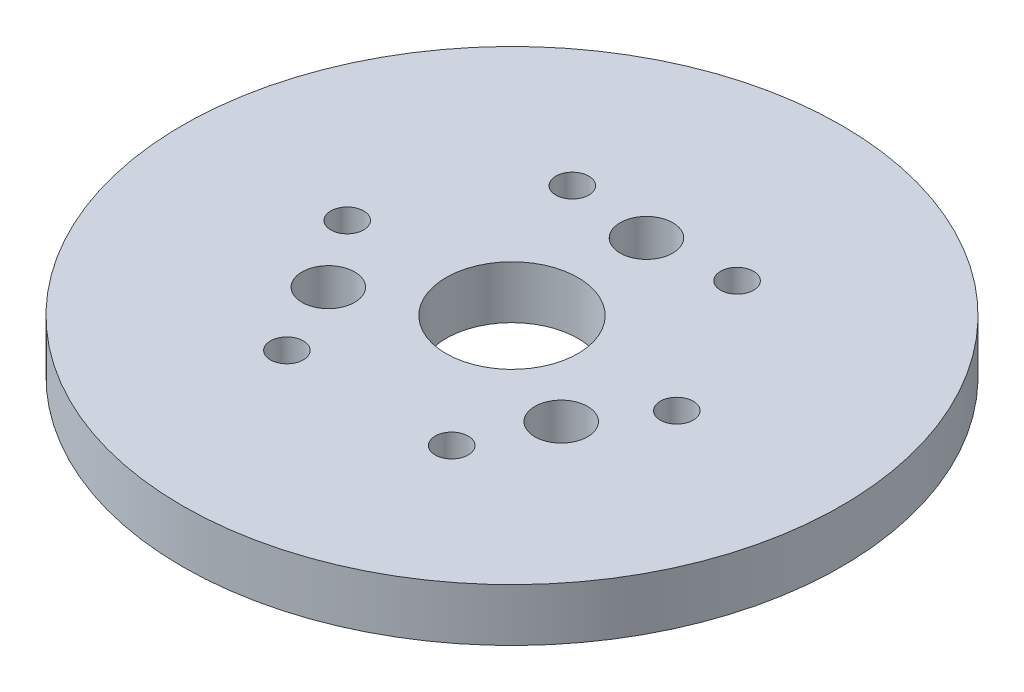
ISO-10303-21;
HEADER;
FILE_DESCRIPTION(('STEP AP214'),'2;1');
FILE_NAME('part.step','',(''),(''),'','','');
FILE_SCHEMA(('AUTOMOTIVE_DESIGN { 1 0 10303 214 1 1 1 1 }'));
ENDSEC;
DATA;
#1=APPLICATION_CONTEXT('core data for automotive mechanical design processes');
#2=APPLICATION_PROTOCOL_DEFINITION('international standard','automotive_design',2000,#1);
#3=PRODUCT_CONTEXT('',#1,'mechanical');
#4=PRODUCT('Part','Part','',(#3));
#5=PRODUCT_RELATED_PRODUCT_CATEGORY('part','',(#4));
#6=PRODUCT_DEFINITION_FORMATION('','',#4);
#7=PRODUCT_DEFINITION_CONTEXT('part definition',#1,'design');
#8=PRODUCT_DEFINITION('design','',#6,#7);
#9=PRODUCT_DEFINITION_SHAPE('','',#8);
#10=(LENGTH_UNIT() NAMED_UNIT(*) SI_UNIT(.MILLI.,.METRE.));
#11=(NAMED_UNIT(*) PLANE_ANGLE_UNIT() SI_UNIT($,.RADIAN.));
#12=(NAMED_UNIT(*) SI_UNIT($,.STERADIAN.) SOLID_ANGLE_UNIT());
#13=UNCERTAINTY_MEASURE_WITH_UNIT(LENGTH_MEASURE(1.E-05),#10,'distance_accuracy_value','');
#14=(GEOMETRIC_REPRESENTATION_CONTEXT(3) GLOBAL_UNCERTAINTY_ASSIGNED_CONTEXT((#13)) GLOBAL_UNIT_ASSIGNED_CONTEXT((#10,
#11,#12)) REPRESENTATION_CONTEXT('',''));
#15=CARTESIAN_POINT('',(0.,0.,0.));
#16=DIRECTION('',(0.,0.,1.));
#17=DIRECTION('',(1.,0.,0.));
#18=AXIS2_PLACEMENT_3D('',#15,#16,#17);
#19=CARTESIAN_POINT('',(0.,4.,0.));
#20=DIRECTION('',(0.,-1.,0.));
#21=DIRECTION('',(0.,0.,-1.));
#22=AXIS2_PLACEMENT_3D('',#19,#20,#21);
#23=CYLINDRICAL_SURFACE('',#22,25.);
#24=CARTESIAN_POINT('',(0.,4.,0.));
#25=DIRECTION('',(0.,1.,0.));
#26=DIRECTION('',(0.,0.,1.));
#27=AXIS2_PLACEMENT_3D('',#24,#25,#26);
#28=CIRCLE('',#27,25.);
#29=CARTESIAN_POINT('',(0.,4.,25.));
#30=VERTEX_POINT('',#29);
#31=EDGE_CURVE('E10',#30,#30,#28,.T.);
#32=ORIENTED_EDGE('',*,*,#31,.F.);
#33=EDGE_LOOP('',(#32));
#34=FACE_BOUND('',#33,.T.);
#35=CARTESIAN_POINT('',(0.,0.,0.));
#36=DIRECTION('',(0.,1.,0.));
#37=DIRECTION('',(0.,0.,1.));
#38=AXIS2_PLACEMENT_3D('',#35,#36,#37);
#39=CIRCLE('',#38,25.);
#40=CARTESIAN_POINT('',(0.,0.,25.));
#41=VERTEX_POINT('',#40);
#42=EDGE_CURVE('E51',#41,#41,#39,.T.);
#43=ORIENTED_EDGE('',*,*,#42,.T.);
#44=EDGE_LOOP('',(#43));
#45=FACE_BOUND('',#44,.T.);
#46=ADVANCED_FACE('F43',(#34,#45),#23,.T.);
#47=CARTESIAN_POINT('',(0.,4.,0.));
#48=DIRECTION('',(0.,1.,0.));
#49=DIRECTION('',(0.,0.,1.));
#50=AXIS2_PLACEMENT_3D('',#47,#48,#49);
#51=PLANE('',#50);
#52=CARTESIAN_POINT('',(0.,4.,-10.2));
#53=DIRECTION('',(0.,1.,0.));
#54=DIRECTION('',(0.,0.,1.));
#55=AXIS2_PLACEMENT_3D('',#52,#53,#54);
#56=CIRCLE('',#55,2.);
#57=CARTESIAN_POINT('',(0.,4.,-8.2));
#58=VERTEX_POINT('',#57);
#59=EDGE_CURVE('E206',#58,#58,#56,.T.);
#60=ORIENTED_EDGE('',*,*,#59,.F.);
#61=EDGE_LOOP('',(#60));
#62=FACE_BOUND('',#61,.T.);
#63=CARTESIAN_POINT('',(6.25,4.,-10.8253175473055));
#64=DIRECTION('',(0.,1.,0.));
#65=DIRECTION('',(0.,0.,1.));
#66=AXIS2_PLACEMENT_3D('',#63,#64,#65);
#67=CIRCLE('',#66,1.25);
#68=CARTESIAN_POINT('',(6.25,4.,-9.57531754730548));
#69=VERTEX_POINT('',#68);
#70=EDGE_CURVE('E210',#69,#69,#67,.T.);
#71=ORIENTED_EDGE('',*,*,#70,.F.);
#72=EDGE_LOOP('',(#71));
#73=FACE_BOUND('',#72,.T.);
#74=CARTESIAN_POINT('',(12.5000000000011,4.,-1.8395627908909E-12));
#75=DIRECTION('',(0.,1.,0.));
#76=DIRECTION('',(0.,0.,1.));
#77=AXIS2_PLACEMENT_3D('',#74,#75,#76);
#78=CIRCLE('',#77,1.25000000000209);
#79=CARTESIAN_POINT('',(12.5000000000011,4.,1.25000000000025));
#80=VERTEX_POINT('',#79);
#81=EDGE_CURVE('E193',#80,#80,#78,.T.);
#82=ORIENTED_EDGE('',*,*,#81,.F.);
#83=EDGE_LOOP('',(#82));
#84=FACE_BOUND('',#83,.T.);
#85=CARTESIAN_POINT('',(8.83345911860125,4.,5.10000000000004));
#86=DIRECTION('',(0.,1.,0.));
#87=DIRECTION('',(0.,0.,1.));
#88=AXIS2_PLACEMENT_3D('',#85,#86,#87);
#89=CIRCLE('',#88,2.);
#90=CARTESIAN_POINT('',(8.83345911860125,4.,7.10000000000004));
#91=VERTEX_POINT('',#90);
#92=EDGE_CURVE('E187',#91,#91,#89,.T.);
#93=ORIENTED_EDGE('',*,*,#92,.F.);
#94=EDGE_LOOP('',(#93));
#95=FACE_BOUND('',#94,.T.);
#96=CARTESIAN_POINT('',(6.25000000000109,4.,10.8253175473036));
#97=DIRECTION('',(0.,1.,0.));
#98=DIRECTION('',(0.,0.,1.));
#99=AXIS2_PLACEMENT_3D('',#96,#97,#98);
#100=CIRCLE('',#99,1.25000000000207);
#101=CARTESIAN_POINT('',(6.25000000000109,4.,12.0753175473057));
#102=VERTEX_POINT('',#101);
#103=EDGE_CURVE('E165',#102,#102,#100,.T.);
#104=ORIENTED_EDGE('',*,*,#103,.F.);
#105=EDGE_LOOP('',(#104));
#106=FACE_BOUND('',#105,.T.);
#107=CARTESIAN_POINT('',(-6.24999999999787,4.,10.8253175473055));
#108=DIRECTION('',(0.,1.,0.));
#109=DIRECTION('',(0.,0.,1.));
#110=AXIS2_PLACEMENT_3D('',#107,#108,#109);
#111=CIRCLE('',#110,1.25000000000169);
#112=CARTESIAN_POINT('',(-6.24999999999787,4.,12.0753175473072));
#113=VERTEX_POINT('',#112);
#114=EDGE_CURVE('E188',#113,#113,#111,.T.);
#115=ORIENTED_EDGE('',*,*,#114,.F.);
#116=EDGE_LOOP('',(#115));
#117=FACE_BOUND('',#116,.T.);
#118=CARTESIAN_POINT('',(-8.83345911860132,4.,5.09999999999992));
#119=DIRECTION('',(0.,1.,0.));
#120=DIRECTION('',(0.,0.,1.));
#121=AXIS2_PLACEMENT_3D('',#118,#119,#120);
#122=CIRCLE('',#121,2.);
#123=CARTESIAN_POINT('',(-8.83345911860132,4.,7.09999999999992));
#124=VERTEX_POINT('',#123);
#125=EDGE_CURVE('E196',#124,#124,#122,.T.);
#126=ORIENTED_EDGE('',*,*,#125,.F.);
#127=EDGE_LOOP('',(#126));
#128=FACE_BOUND('',#127,.T.);
#129=CARTESIAN_POINT('',(-12.4999999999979,4.,0.));
#130=DIRECTION('',(0.,1.,0.));
#131=DIRECTION('',(0.,0.,1.));
#132=AXIS2_PLACEMENT_3D('',#129,#130,#131);
#133=CIRCLE('',#132,1.25000000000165);
#134=CARTESIAN_POINT('',(-12.4999999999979,4.,1.25000000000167));
#135=VERTEX_POINT('',#134);
#136=EDGE_CURVE('E202',#135,#135,#133,.T.);
#137=ORIENTED_EDGE('',*,*,#136,.F.);
#138=EDGE_LOOP('',(#137));
#139=FACE_BOUND('',#138,.T.);
#140=CARTESIAN_POINT('',(-6.25,4.,-10.8253175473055));
#141=DIRECTION('',(0.,1.,0.));
#142=DIRECTION('',(0.,0.,1.));
#143=AXIS2_PLACEMENT_3D('',#140,#141,#142);
#144=CIRCLE('',#143,1.25);
#145=CARTESIAN_POINT('',(-6.25,4.,-9.57531754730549));
#146=VERTEX_POINT('',#145);
#147=EDGE_CURVE('E71',#146,#146,#144,.T.);
#148=ORIENTED_EDGE('',*,*,#147,.F.);
#149=EDGE_LOOP('',(#148));
#150=FACE_BOUND('',#149,.T.);
#151=CARTESIAN_POINT('',(0.,4.,0.));
#152=DIRECTION('',(0.,1.,0.));
#153=DIRECTION('',(0.,0.,1.));
#154=AXIS2_PLACEMENT_3D('',#151,#152,#153);
#155=CIRCLE('',#154,5.);
#156=CARTESIAN_POINT('',(0.,4.,5.));
#157=VERTEX_POINT('',#156);
#158=EDGE_CURVE('E60',#157,#157,#155,.T.);
#159=ORIENTED_EDGE('',*,*,#158,.F.);
#160=EDGE_LOOP('',(#159));
#161=FACE_BOUND('',#160,.T.);
#162=ORIENTED_EDGE('',*,*,#31,.T.);
#163=EDGE_LOOP('',(#162));
#164=FACE_BOUND('',#163,.T.);
#165=ADVANCED_FACE('F110',(#62,#73,#84,#95,#106,#117,#128,#139,#150,#161,#164),#51,.T.);
#166=CARTESIAN_POINT('',(0.,0.,0.));
#167=DIRECTION('',(0.,1.,0.));
#168=DIRECTION('',(0.,0.,1.));
#169=AXIS2_PLACEMENT_3D('',#166,#167,#168);
#170=PLANE('',#169);
#171=CARTESIAN_POINT('',(0.,0.,-10.2));
#172=DIRECTION('',(0.,1.,0.));
#173=DIRECTION('',(0.,0.,1.));
#174=AXIS2_PLACEMENT_3D('',#171,#172,#173);
#175=CIRCLE('',#174,2.);
#176=CARTESIAN_POINT('',(0.,0.,-8.2));
#177=VERTEX_POINT('',#176);
#178=EDGE_CURVE('E46',#177,#177,#175,.T.);
#179=ORIENTED_EDGE('',*,*,#178,.T.);
#180=EDGE_LOOP('',(#179));
#181=FACE_BOUND('',#180,.T.);
#182=CARTESIAN_POINT('',(6.25,0.,-10.8253175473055));
#183=DIRECTION('',(0.,1.,0.));
#184=DIRECTION('',(0.,0.,1.));
#185=AXIS2_PLACEMENT_3D('',#182,#183,#184);
#186=CIRCLE('',#185,1.25);
#187=CARTESIAN_POINT('',(6.25,0.,-9.57531754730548));
#188=VERTEX_POINT('',#187);
#189=EDGE_CURVE('E94',#188,#188,#186,.T.);
#190=ORIENTED_EDGE('',*,*,#189,.T.);
#191=EDGE_LOOP('',(#190));
#192=FACE_BOUND('',#191,.T.);
#193=CARTESIAN_POINT('',(12.5000000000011,0.,-1.8395627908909E-12));
#194=DIRECTION('',(0.,1.,0.));
#195=DIRECTION('',(0.,0.,1.));
#196=AXIS2_PLACEMENT_3D('',#193,#194,#195);
#197=CIRCLE('',#196,1.25000000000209);
#198=CARTESIAN_POINT('',(12.5000000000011,0.,1.25000000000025));
#199=VERTEX_POINT('',#198);
#200=EDGE_CURVE('E91',#199,#199,#197,.T.);
#201=ORIENTED_EDGE('',*,*,#200,.T.);
#202=EDGE_LOOP('',(#201));
#203=FACE_BOUND('',#202,.T.);
#204=CARTESIAN_POINT('',(8.83345911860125,0.,5.10000000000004));
#205=DIRECTION('',(0.,1.,0.));
#206=DIRECTION('',(0.,0.,1.));
#207=AXIS2_PLACEMENT_3D('',#204,#205,#206);
#208=CIRCLE('',#207,2.);
#209=CARTESIAN_POINT('',(8.83345911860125,0.,7.10000000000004));
#210=VERTEX_POINT('',#209);
#211=EDGE_CURVE('E87',#210,#210,#208,.T.);
#212=ORIENTED_EDGE('',*,*,#211,.T.);
#213=EDGE_LOOP('',(#212));
#214=FACE_BOUND('',#213,.T.);
#215=CARTESIAN_POINT('',(6.25000000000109,0.,10.8253175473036));
#216=DIRECTION('',(0.,1.,0.));
#217=DIRECTION('',(0.,0.,1.));
#218=AXIS2_PLACEMENT_3D('',#215,#216,#217);
#219=CIRCLE('',#218,1.25000000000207);
#220=CARTESIAN_POINT('',(6.25000000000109,0.,12.0753175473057));
#221=VERTEX_POINT('',#220);
#222=EDGE_CURVE('E83',#221,#221,#219,.T.);
#223=ORIENTED_EDGE('',*,*,#222,.T.);
#224=EDGE_LOOP('',(#223));
#225=FACE_BOUND('',#224,.T.);
#226=CARTESIAN_POINT('',(-6.24999999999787,0.,10.8253175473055));
#227=DIRECTION('',(0.,1.,0.));
#228=DIRECTION('',(0.,0.,1.));
#229=AXIS2_PLACEMENT_3D('',#226,#227,#228);
#230=CIRCLE('',#229,1.25000000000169);
#231=CARTESIAN_POINT('',(-6.24999999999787,0.,12.0753175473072));
#232=VERTEX_POINT('',#231);
#233=EDGE_CURVE('E79',#232,#232,#230,.T.);
#234=ORIENTED_EDGE('',*,*,#233,.T.);
#235=EDGE_LOOP('',(#234));
#236=FACE_BOUND('',#235,.T.);
#237=CARTESIAN_POINT('',(-8.83345911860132,0.,5.09999999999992));
#238=DIRECTION('',(0.,1.,0.));
#239=DIRECTION('',(0.,0.,1.));
#240=AXIS2_PLACEMENT_3D('',#237,#238,#239);
#241=CIRCLE('',#240,2.);
#242=CARTESIAN_POINT('',(-8.83345911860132,0.,7.09999999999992));
#243=VERTEX_POINT('',#242);
#244=EDGE_CURVE('E75',#243,#243,#241,.T.);
#245=ORIENTED_EDGE('',*,*,#244,.T.);
#246=EDGE_LOOP('',(#245));
#247=FACE_BOUND('',#246,.T.);
#248=CARTESIAN_POINT('',(-12.4999999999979,0.,0.));
#249=DIRECTION('',(0.,1.,0.));
#250=DIRECTION('',(0.,0.,1.));
#251=AXIS2_PLACEMENT_3D('',#248,#249,#250);
#252=CIRCLE('',#251,1.25000000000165);
#253=CARTESIAN_POINT('',(-12.4999999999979,0.,1.25000000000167));
#254=VERTEX_POINT('',#253);
#255=EDGE_CURVE('E70',#254,#254,#252,.T.);
#256=ORIENTED_EDGE('',*,*,#255,.T.);
#257=EDGE_LOOP('',(#256));
#258=FACE_BOUND('',#257,.T.);
#259=CARTESIAN_POINT('',(-6.25,0.,-10.8253175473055));
#260=DIRECTION('',(0.,1.,0.));
#261=DIRECTION('',(0.,0.,1.));
#262=AXIS2_PLACEMENT_3D('',#259,#260,#261);
#263=CIRCLE('',#262,1.25);
#264=CARTESIAN_POINT('',(-6.25,0.,-9.57531754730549));
#265=VERTEX_POINT('',#264);
#266=EDGE_CURVE('E66',#265,#265,#263,.T.);
#267=ORIENTED_EDGE('',*,*,#266,.T.);
#268=EDGE_LOOP('',(#267));
#269=FACE_BOUND('',#268,.T.);
#270=CARTESIAN_POINT('',(0.,0.,0.));
#271=DIRECTION('',(0.,1.,0.));
#272=DIRECTION('',(0.,0.,1.));
#273=AXIS2_PLACEMENT_3D('',#270,#271,#272);
#274=CIRCLE('',#273,5.);
#275=CARTESIAN_POINT('',(0.,0.,5.));
#276=VERTEX_POINT('',#275);
#277=EDGE_CURVE('E57',#276,#276,#274,.T.);
#278=ORIENTED_EDGE('',*,*,#277,.T.);
#279=EDGE_LOOP('',(#278));
#280=FACE_BOUND('',#279,.T.);
#281=ORIENTED_EDGE('',*,*,#42,.F.);
#282=EDGE_LOOP('',(#281));
#283=FACE_BOUND('',#282,.T.);
#284=ADVANCED_FACE('F112',(#181,#192,#203,#214,#225,#236,#247,#258,#269,#280,#283),#170,.F.);
#285=CARTESIAN_POINT('',(0.,-16.7,0.));
#286=DIRECTION('',(0.,1.,0.));
#287=DIRECTION('',(0.,0.,1.));
#288=AXIS2_PLACEMENT_3D('',#285,#286,#287);
#289=CYLINDRICAL_SURFACE('',#288,5.);
#290=ORIENTED_EDGE('',*,*,#158,.T.);
#291=EDGE_LOOP('',(#290));
#292=FACE_BOUND('',#291,.T.);
#293=ORIENTED_EDGE('',*,*,#277,.F.);
#294=EDGE_LOOP('',(#293));
#295=FACE_BOUND('',#294,.T.);
#296=ADVANCED_FACE('F107',(#292,#295),#289,.F.);
#297=CARTESIAN_POINT('',(-6.25,-6.,-10.8253175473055));
#298=DIRECTION('',(0.,1.,0.));
#299=DIRECTION('',(0.,0.,1.));
#300=AXIS2_PLACEMENT_3D('',#297,#298,#299);
#301=CYLINDRICAL_SURFACE('',#300,1.25);
#302=ORIENTED_EDGE('',*,*,#147,.T.);
#303=EDGE_LOOP('',(#302));
#304=FACE_BOUND('',#303,.T.);
#305=ORIENTED_EDGE('',*,*,#266,.F.);
#306=EDGE_LOOP('',(#305));
#307=FACE_BOUND('',#306,.T.);
#308=ADVANCED_FACE('F125',(#304,#307),#301,.F.);
#309=CARTESIAN_POINT('',(-12.4999999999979,-6.,0.));
#310=DIRECTION('',(0.,1.,0.));
#311=DIRECTION('',(0.,0.,1.));
#312=AXIS2_PLACEMENT_3D('',#309,#310,#311);
#313=CYLINDRICAL_SURFACE('',#312,1.25000000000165);
#314=ORIENTED_EDGE('',*,*,#136,.T.);
#315=EDGE_LOOP('',(#314));
#316=FACE_BOUND('',#315,.T.);
#317=ORIENTED_EDGE('',*,*,#255,.F.);
#318=EDGE_LOOP('',(#317));
#319=FACE_BOUND('',#318,.T.);
#320=ADVANCED_FACE('F128',(#316,#319),#313,.F.);
#321=CARTESIAN_POINT('',(-8.83345911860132,-6.,5.09999999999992));
#322=DIRECTION('',(0.,1.,0.));
#323=DIRECTION('',(0.,0.,1.));
#324=AXIS2_PLACEMENT_3D('',#321,#322,#323);
#325=CYLINDRICAL_SURFACE('',#324,2.);
#326=ORIENTED_EDGE('',*,*,#125,.T.);
#327=EDGE_LOOP('',(#326));
#328=FACE_BOUND('',#327,.T.);
#329=ORIENTED_EDGE('',*,*,#244,.F.);
#330=EDGE_LOOP('',(#329));
#331=FACE_BOUND('',#330,.T.);
#332=ADVANCED_FACE('F149',(#328,#331),#325,.F.);
#333=CARTESIAN_POINT('',(-6.24999999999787,-6.,10.8253175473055));
#334=DIRECTION('',(0.,1.,0.));
#335=DIRECTION('',(0.,0.,1.));
#336=AXIS2_PLACEMENT_3D('',#333,#334,#335);
#337=CYLINDRICAL_SURFACE('',#336,1.25000000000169);
#338=ORIENTED_EDGE('',*,*,#114,.T.);
#339=EDGE_LOOP('',(#338));
#340=FACE_BOUND('',#339,.T.);
#341=ORIENTED_EDGE('',*,*,#233,.F.);
#342=EDGE_LOOP('',(#341));
#343=FACE_BOUND('',#342,.T.);
#344=ADVANCED_FACE('F153',(#340,#343),#337,.F.);
#345=CARTESIAN_POINT('',(6.25000000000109,-6.,10.8253175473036));
#346=DIRECTION('',(0.,1.,0.));
#347=DIRECTION('',(0.,0.,1.));
#348=AXIS2_PLACEMENT_3D('',#345,#346,#347);
#349=CYLINDRICAL_SURFACE('',#348,1.25000000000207);
#350=ORIENTED_EDGE('',*,*,#103,.T.);
#351=EDGE_LOOP('',(#350));
#352=FACE_BOUND('',#351,.T.);
#353=ORIENTED_EDGE('',*,*,#222,.F.);
#354=EDGE_LOOP('',(#353));
#355=FACE_BOUND('',#354,.T.);
#356=ADVANCED_FACE('F134',(#352,#355),#349,.F.);
#357=CARTESIAN_POINT('',(8.83345911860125,-6.,5.10000000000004));
#358=DIRECTION('',(0.,1.,0.));
#359=DIRECTION('',(0.,0.,1.));
#360=AXIS2_PLACEMENT_3D('',#357,#358,#359);
#361=CYLINDRICAL_SURFACE('',#360,2.);
#362=ORIENTED_EDGE('',*,*,#92,.T.);
#363=EDGE_LOOP('',(#362));
#364=FACE_BOUND('',#363,.T.);
#365=ORIENTED_EDGE('',*,*,#211,.F.);
#366=EDGE_LOOP('',(#365));
#367=FACE_BOUND('',#366,.T.);
#368=ADVANCED_FACE('F130',(#364,#367),#361,.F.);
#369=CARTESIAN_POINT('',(12.5000000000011,-6.,-1.8395627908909E-12));
#370=DIRECTION('',(0.,1.,0.));
#371=DIRECTION('',(0.,0.,1.));
#372=AXIS2_PLACEMENT_3D('',#369,#370,#371);
#373=CYLINDRICAL_SURFACE('',#372,1.25000000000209);
#374=ORIENTED_EDGE('',*,*,#81,.T.);
#375=EDGE_LOOP('',(#374));
#376=FACE_BOUND('',#375,.T.);
#377=ORIENTED_EDGE('',*,*,#200,.F.);
#378=EDGE_LOOP('',(#377));
#379=FACE_BOUND('',#378,.T.);
#380=ADVANCED_FACE('F133',(#376,#379),#373,.F.);
#381=CARTESIAN_POINT('',(6.25,-6.,-10.8253175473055));
#382=DIRECTION('',(0.,1.,0.));
#383=DIRECTION('',(0.,0.,1.));
#384=AXIS2_PLACEMENT_3D('',#381,#382,#383);
#385=CYLINDRICAL_SURFACE('',#384,1.25);
#386=ORIENTED_EDGE('',*,*,#70,.T.);
#387=EDGE_LOOP('',(#386));
#388=FACE_BOUND('',#387,.T.);
#389=ORIENTED_EDGE('',*,*,#189,.F.);
#390=EDGE_LOOP('',(#389));
#391=FACE_BOUND('',#390,.T.);
#392=ADVANCED_FACE('F138',(#388,#391),#385,.F.);
#393=CARTESIAN_POINT('',(0.,-6.,-10.2));
#394=DIRECTION('',(0.,1.,0.));
#395=DIRECTION('',(0.,0.,1.));
#396=AXIS2_PLACEMENT_3D('',#393,#394,#395);
#397=CYLINDRICAL_SURFACE('',#396,2.);
#398=ORIENTED_EDGE('',*,*,#59,.T.);
#399=EDGE_LOOP('',(#398));
#400=FACE_BOUND('',#399,.T.);
#401=ORIENTED_EDGE('',*,*,#178,.F.);
#402=EDGE_LOOP('',(#401));
#403=FACE_BOUND('',#402,.T.);
#404=ADVANCED_FACE('F142',(#400,#403),#397,.F.);
#405=CLOSED_SHELL('',(#46,#165,#284,#296,#308,#320,#332,#344,#356,#368,#380,#392,#404));
#406=MANIFOLD_SOLID_BREP('B2',#405);
#407=ADVANCED_BREP_SHAPE_REPRESENTATION('',(#18,#406),#14);
#408=SHAPE_DEFINITION_REPRESENTATION(#9,#407);
ENDSEC;
END-ISO-10303-21;
